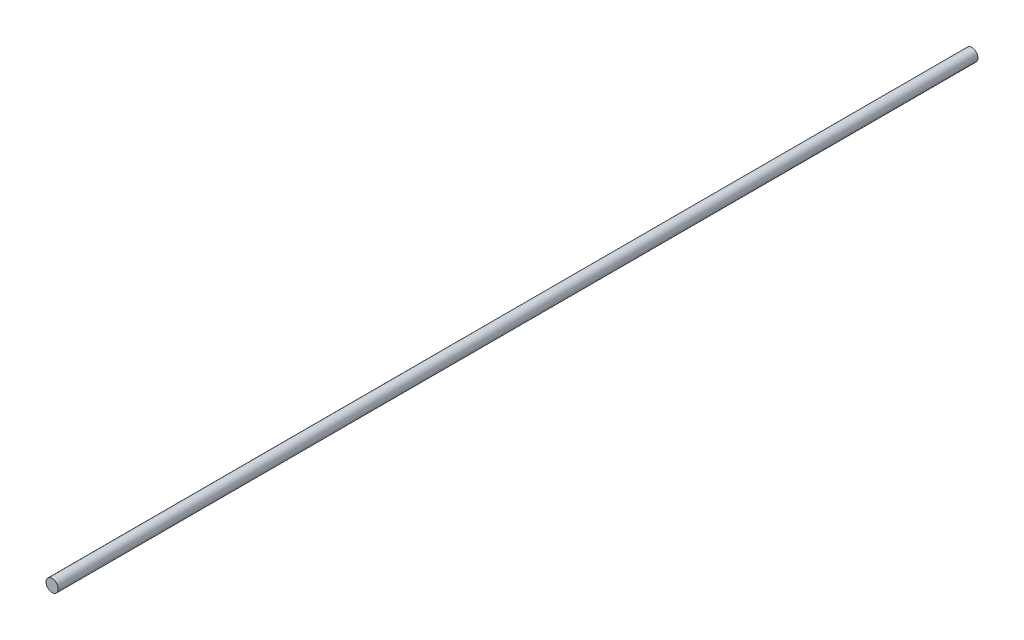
ISO-10303-21;
HEADER;
FILE_DESCRIPTION(('STEP AP214'),'2;1');
FILE_NAME('part.step','',(''),(''),'','','');
FILE_SCHEMA(('AUTOMOTIVE_DESIGN { 1 0 10303 214 1 1 1 1 }'));
ENDSEC;
DATA;
#1=APPLICATION_CONTEXT('core data for automotive mechanical design processes');
#2=APPLICATION_PROTOCOL_DEFINITION('international standard','automotive_design',2000,#1);
#3=PRODUCT_CONTEXT('',#1,'mechanical');
#4=PRODUCT('Part','Part','',(#3));
#5=PRODUCT_RELATED_PRODUCT_CATEGORY('part','',(#4));
#6=PRODUCT_DEFINITION_FORMATION('','',#4);
#7=PRODUCT_DEFINITION_CONTEXT('part definition',#1,'design');
#8=PRODUCT_DEFINITION('design','',#6,#7);
#9=PRODUCT_DEFINITION_SHAPE('','',#8);
#10=(LENGTH_UNIT() NAMED_UNIT(*) SI_UNIT(.MILLI.,.METRE.));
#11=(NAMED_UNIT(*) PLANE_ANGLE_UNIT() SI_UNIT($,.RADIAN.));
#12=(NAMED_UNIT(*) SI_UNIT($,.STERADIAN.) SOLID_ANGLE_UNIT());
#13=UNCERTAINTY_MEASURE_WITH_UNIT(LENGTH_MEASURE(1.E-05),#10,'distance_accuracy_value','');
#14=(GEOMETRIC_REPRESENTATION_CONTEXT(3) GLOBAL_UNCERTAINTY_ASSIGNED_CONTEXT((#13)) GLOBAL_UNIT_ASSIGNED_CONTEXT((#10,
#11,#12)) REPRESENTATION_CONTEXT('',''));
#15=CARTESIAN_POINT('',(0.,0.,0.));
#16=DIRECTION('',(0.,0.,1.));
#17=DIRECTION('',(1.,0.,0.));
#18=AXIS2_PLACEMENT_3D('',#15,#16,#17);
#19=CARTESIAN_POINT('',(0.,0.,-4500.));
#20=DIRECTION('',(0.,0.,1.));
#21=DIRECTION('',(1.,0.,0.));
#22=AXIS2_PLACEMENT_3D('',#19,#20,#21);
#23=CYLINDRICAL_SURFACE('',#22,30.);
#24=CARTESIAN_POINT('',(0.,0.,-4500.));
#25=DIRECTION('',(0.,0.,1.));
#26=DIRECTION('',(1.,0.,0.));
#27=AXIS2_PLACEMENT_3D('',#24,#25,#26);
#28=CIRCLE('',#27,30.);
#29=CARTESIAN_POINT('',(30.,0.,-4500.));
#30=VERTEX_POINT('',#29);
#31=EDGE_CURVE('E10',#30,#30,#28,.T.);
#32=ORIENTED_EDGE('',*,*,#31,.T.);
#33=EDGE_LOOP('',(#32));
#34=FACE_BOUND('',#33,.T.);
#35=CARTESIAN_POINT('',(0.,0.,0.));
#36=DIRECTION('',(0.,0.,1.));
#37=DIRECTION('',(1.,0.,0.));
#38=AXIS2_PLACEMENT_3D('',#35,#36,#37);
#39=CIRCLE('',#38,30.);
#40=CARTESIAN_POINT('',(30.,0.,0.));
#41=VERTEX_POINT('',#40);
#42=EDGE_CURVE('E40',#41,#41,#39,.T.);
#43=ORIENTED_EDGE('',*,*,#42,.F.);
#44=EDGE_LOOP('',(#43));
#45=FACE_BOUND('',#44,.T.);
#46=ADVANCED_FACE('F37',(#34,#45),#23,.T.);
#47=CARTESIAN_POINT('',(0.,0.,-4500.));
#48=DIRECTION('',(0.,0.,1.));
#49=DIRECTION('',(1.,0.,0.));
#50=AXIS2_PLACEMENT_3D('',#47,#48,#49);
#51=PLANE('',#50);
#52=ORIENTED_EDGE('',*,*,#31,.F.);
#53=EDGE_LOOP('',(#52));
#54=FACE_BOUND('',#53,.T.);
#55=ADVANCED_FACE('F54',(#54),#51,.F.);
#56=CARTESIAN_POINT('',(0.,0.,0.));
#57=DIRECTION('',(0.,0.,1.));
#58=DIRECTION('',(1.,0.,0.));
#59=AXIS2_PLACEMENT_3D('',#56,#57,#58);
#60=PLANE('',#59);
#61=ORIENTED_EDGE('',*,*,#42,.T.);
#62=EDGE_LOOP('',(#61));
#63=FACE_BOUND('',#62,.T.);
#64=ADVANCED_FACE('F51',(#63),#60,.T.);
#65=CLOSED_SHELL('',(#46,#55,#64));
#66=MANIFOLD_SOLID_BREP('B2',#65);
#67=ADVANCED_BREP_SHAPE_REPRESENTATION('',(#18,#66),#14);
#68=SHAPE_DEFINITION_REPRESENTATION(#9,#67);
ENDSEC;
END-ISO-10303-21;
